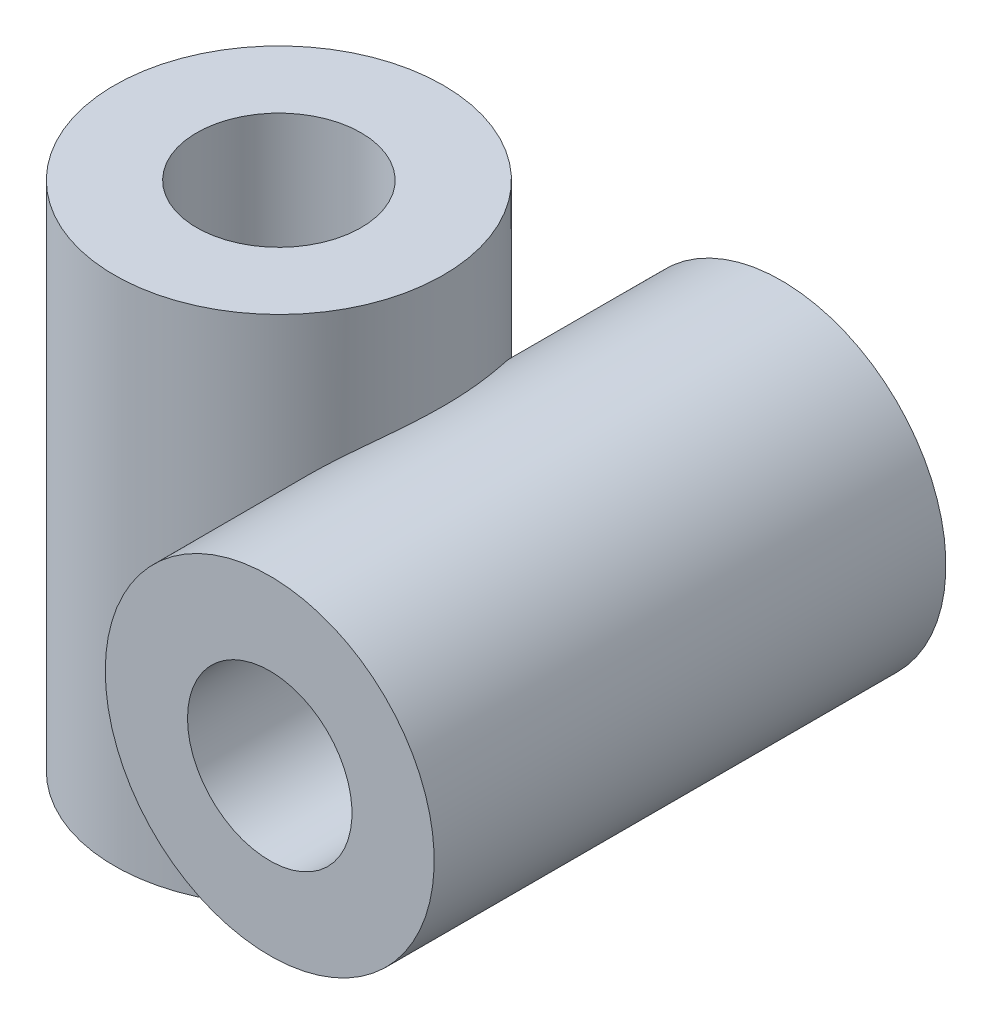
ISO-10303-21;
HEADER;
FILE_DESCRIPTION(('STEP AP214'),'2;1');
FILE_NAME('part.step','',(''),(''),'','','');
FILE_SCHEMA(('AUTOMOTIVE_DESIGN { 1 0 10303 214 1 1 1 1 }'));
ENDSEC;
DATA;
#1=APPLICATION_CONTEXT('core data for automotive mechanical design processes');
#2=APPLICATION_PROTOCOL_DEFINITION('international standard','automotive_design',2000,#1);
#3=PRODUCT_CONTEXT('',#1,'mechanical');
#4=PRODUCT('Part','Part','',(#3));
#5=PRODUCT_RELATED_PRODUCT_CATEGORY('part','',(#4));
#6=PRODUCT_DEFINITION_FORMATION('','',#4);
#7=PRODUCT_DEFINITION_CONTEXT('part definition',#1,'design');
#8=PRODUCT_DEFINITION('design','',#6,#7);
#9=PRODUCT_DEFINITION_SHAPE('','',#8);
#10=(LENGTH_UNIT() NAMED_UNIT(*) SI_UNIT(.MILLI.,.METRE.));
#11=(NAMED_UNIT(*) PLANE_ANGLE_UNIT() SI_UNIT($,.RADIAN.));
#12=(NAMED_UNIT(*) SI_UNIT($,.STERADIAN.) SOLID_ANGLE_UNIT());
#13=UNCERTAINTY_MEASURE_WITH_UNIT(LENGTH_MEASURE(1.E-05),#10,'distance_accuracy_value','');
#14=(GEOMETRIC_REPRESENTATION_CONTEXT(3) GLOBAL_UNCERTAINTY_ASSIGNED_CONTEXT((#13)) GLOBAL_UNIT_ASSIGNED_CONTEXT((#10,
#11,#12)) REPRESENTATION_CONTEXT('',''));
#15=CARTESIAN_POINT('',(0.,0.,0.));
#16=DIRECTION('',(0.,0.,1.));
#17=DIRECTION('',(1.,0.,0.));
#18=AXIS2_PLACEMENT_3D('',#15,#16,#17);
#19=CARTESIAN_POINT('',(13.5,0.,14.00003));
#20=DIRECTION('',(0.,0.,-1.));
#21=DIRECTION('',(-1.,0.,0.));
#22=AXIS2_PLACEMENT_3D('',#19,#20,#21);
#23=CYLINDRICAL_SURFACE('',#22,9.);
#24=CARTESIAN_POINT('',(4.5,0.,7.79422863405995));
#25=CARTESIAN_POINT('',(4.49999878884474,0.210530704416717,7.79422744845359));
#26=CARTESIAN_POINT('',(4.50739316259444,0.421042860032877,7.78997368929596));
#27=CARTESIAN_POINT('',(4.53688683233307,0.840749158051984,7.77283452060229));
#28=CARTESIAN_POINT('',(4.55898999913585,1.04994293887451,7.75994683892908));
#29=CARTESIAN_POINT('',(4.61768183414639,1.46580210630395,7.72516517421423));
#30=CARTESIAN_POINT('',(4.65428858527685,1.67246400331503,7.70325994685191));
#31=CARTESIAN_POINT('',(4.74152309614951,2.08154101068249,7.64987402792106));
#32=CARTESIAN_POINT('',(4.79214987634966,2.2839564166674,7.61839400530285));
#33=CARTESIAN_POINT('',(4.90686390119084,2.68352543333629,7.54502024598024));
#34=CARTESIAN_POINT('',(4.97098135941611,2.88066609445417,7.50310309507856));
#35=CARTESIAN_POINT('',(5.11163620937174,3.26768097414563,7.40799421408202));
#36=CARTESIAN_POINT('',(5.18817384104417,3.4575550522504,7.35480226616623));
#37=CARTESIAN_POINT('',(5.35230548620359,3.8283339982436,7.23623250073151));
#38=CARTESIAN_POINT('',(5.43989058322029,4.00924593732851,7.17086449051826));
#39=CARTESIAN_POINT('',(5.62450750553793,4.36073564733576,7.02699080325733));
#40=CARTESIAN_POINT('',(5.72153872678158,4.53131407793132,6.94848596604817));
#41=CARTESIAN_POINT('',(5.91883748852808,4.85388813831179,6.78110515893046));
#42=CARTESIAN_POINT('',(6.01880394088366,5.00636104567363,6.6927943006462));
#43=CARTESIAN_POINT('',(6.22346287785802,5.29942914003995,6.5029210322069));
#44=CARTESIAN_POINT('',(6.32815522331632,5.44002467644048,6.40135901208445));
#45=CARTESIAN_POINT('',(6.53991020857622,5.70844720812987,6.18485932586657));
#46=CARTESIAN_POINT('',(6.64697194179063,5.8362789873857,6.06992670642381));
#47=CARTESIAN_POINT('',(6.86106162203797,6.0787049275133,5.82683878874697));
#48=CARTESIAN_POINT('',(6.96808957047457,6.19329973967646,5.69868414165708));
#49=CARTESIAN_POINT('',(7.17185654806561,6.40110919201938,5.43963182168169));
#50=CARTESIAN_POINT('',(7.2687717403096,6.49527774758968,5.30963550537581));
#51=CARTESIAN_POINT('',(7.45864427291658,6.672246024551,5.03943293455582));
#52=CARTESIAN_POINT('',(7.55160182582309,6.75504635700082,4.89922722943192));
#53=CARTESIAN_POINT('',(7.73190863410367,6.90964803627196,4.60941662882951));
#54=CARTESIAN_POINT('',(7.81925662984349,6.98144691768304,4.45980963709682));
#55=CARTESIAN_POINT('',(7.98686265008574,7.11454664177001,4.15219322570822));
#56=CARTESIAN_POINT('',(8.06712039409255,7.17584706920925,3.9941834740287));
#57=CARTESIAN_POINT('',(8.22098364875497,7.28981190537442,3.66725778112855));
#58=CARTESIAN_POINT('',(8.29440424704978,7.34225696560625,3.49817848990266));
#59=CARTESIAN_POINT('',(8.43148190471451,7.43754630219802,3.15349291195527));
#60=CARTESIAN_POINT('',(8.49513890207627,7.48039051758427,2.97788658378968));
#61=CARTESIAN_POINT('',(8.61186892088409,7.55718594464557,2.62124579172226));
#62=CARTESIAN_POINT('',(8.66493906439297,7.59113473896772,2.44020986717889));
#63=CARTESIAN_POINT('',(8.75984198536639,7.6507543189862,2.07387978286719));
#64=CARTESIAN_POINT('',(8.80167421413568,7.67642470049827,1.88858541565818));
#65=CARTESIAN_POINT('',(8.87669096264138,7.72185891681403,1.49898951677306));
#66=CARTESIAN_POINT('',(8.90884179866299,7.74093757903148,1.29440827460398));
#67=CARTESIAN_POINT('',(8.95898776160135,7.77046026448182,0.882898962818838));
#68=CARTESIAN_POINT('',(8.97698216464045,7.78090384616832,0.675970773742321));
#69=CARTESIAN_POINT('',(8.99861286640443,7.79343771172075,0.261036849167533));
#70=CARTESIAN_POINT('',(9.00224389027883,7.79552492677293,0.053030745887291));
#71=CARTESIAN_POINT('',(8.995092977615,7.79139447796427,-0.362652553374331));
#72=CARTESIAN_POINT('',(8.98431076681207,7.78517665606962,-0.570329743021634));
#73=CARTESIAN_POINT('',(8.94755589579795,7.76374483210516,-0.994363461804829));
#74=CARTESIAN_POINT('',(8.9208512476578,7.74809690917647,-1.2106352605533));
#75=CARTESIAN_POINT('',(8.85202487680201,7.70700532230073,-1.63978124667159));
#76=CARTESIAN_POINT('',(8.80990249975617,7.68156124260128,-1.85265528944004));
#77=CARTESIAN_POINT('',(8.71082235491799,7.62018188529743,-2.27338404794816));
#78=CARTESIAN_POINT('',(8.65386491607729,7.58424684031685,-2.48123887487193));
#79=CARTESIAN_POINT('',(8.52597562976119,7.50099324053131,-2.89026732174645));
#80=CARTESIAN_POINT('',(8.45504434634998,7.45367514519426,-3.09144121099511));
#81=CARTESIAN_POINT('',(8.30202749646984,7.34775812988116,-3.48127231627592));
#82=CARTESIAN_POINT('',(8.22020769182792,7.28941720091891,-3.67010373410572));
#83=CARTESIAN_POINT('',(8.04579734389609,7.15985101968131,-4.03814380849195));
#84=CARTESIAN_POINT('',(7.95320691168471,7.08862590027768,-4.21735256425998));
#85=CARTESIAN_POINT('',(7.75920504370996,6.93244239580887,-4.56445309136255));
#86=CARTESIAN_POINT('',(7.65780116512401,6.84749572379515,-4.73235434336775));
#87=CARTESIAN_POINT('',(7.44835948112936,6.66311438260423,-5.05559286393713));
#88=CARTESIAN_POINT('',(7.34032231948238,6.56368111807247,-5.21093134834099));
#89=CARTESIAN_POINT('',(7.1293195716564,6.35879108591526,-5.49559442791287));
#90=CARTESIAN_POINT('',(7.0266746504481,6.25451459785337,-5.62600799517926));
#91=CARTESIAN_POINT('',(6.82014578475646,6.03344159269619,-5.87466867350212));
#92=CARTESIAN_POINT('',(6.71626191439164,5.91664582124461,-5.99291650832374));
#93=CARTESIAN_POINT('',(6.50948901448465,5.67085013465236,-6.21689562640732));
#94=CARTESIAN_POINT('',(6.40659988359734,5.54185147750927,-6.3226281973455));
#95=CARTESIAN_POINT('',(6.20398040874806,5.27224120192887,-6.52156366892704));
#96=CARTESIAN_POINT('',(6.10425004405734,5.13162965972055,-6.61476665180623));
#97=CARTESIAN_POINT('',(5.91462959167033,4.84665188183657,-6.78473223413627));
#98=CARTESIAN_POINT('',(5.82449698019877,4.70278792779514,-6.86206839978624));
#99=CARTESIAN_POINT('',(5.65048898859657,4.40621527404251,-7.00604960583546));
#100=CARTESIAN_POINT('',(5.56661336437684,4.25350691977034,-7.0726950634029));
#101=CARTESIAN_POINT('',(5.40643461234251,3.94019852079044,-7.19587943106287));
#102=CARTESIAN_POINT('',(5.33013344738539,3.77959644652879,-7.25241572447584));
#103=CARTESIAN_POINT('',(5.18623581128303,3.45158033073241,-7.35600573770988));
#104=CARTESIAN_POINT('',(5.11863977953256,3.28416594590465,-7.4030589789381));
#105=CARTESIAN_POINT('',(4.98950286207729,2.93397361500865,-7.49074749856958));
#106=CARTESIAN_POINT('',(4.92851917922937,2.75086187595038,-7.53087055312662));
#107=CARTESIAN_POINT('',(4.81808374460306,2.37946845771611,-7.60199868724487));
#108=CARTESIAN_POINT('',(4.76863232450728,2.19118663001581,-7.63300350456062));
#109=CARTESIAN_POINT('',(4.68184831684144,1.8106092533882,-7.68654008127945));
#110=CARTESIAN_POINT('',(4.64451945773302,1.61831248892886,-7.70906923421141));
#111=CARTESIAN_POINT('',(4.58241803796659,1.23094166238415,-7.74614426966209));
#112=CARTESIAN_POINT('',(4.55764599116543,1.03586748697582,-7.76068982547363));
#113=CARTESIAN_POINT('',(4.51943914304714,0.628276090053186,-7.7830076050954));
#114=CARTESIAN_POINT('',(4.50708088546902,0.41562190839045,-7.79013831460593));
#115=CARTESIAN_POINT('',(4.49748663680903,-0.0101469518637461,-7.79568100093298));
#116=CARTESIAN_POINT('',(4.50025145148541,-0.223261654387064,-7.7940925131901));
#117=CARTESIAN_POINT('',(4.52087544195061,-0.648588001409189,-7.78214803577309));
#118=CARTESIAN_POINT('',(4.5387397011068,-0.860799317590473,-7.7717890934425));
#119=CARTESIAN_POINT('',(4.58935541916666,-1.28279951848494,-7.74200733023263));
#120=CARTESIAN_POINT('',(4.62210691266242,-1.49258839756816,-7.72258448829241));
#121=CARTESIAN_POINT('',(4.70312648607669,-1.91367868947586,-7.67351968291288));
#122=CARTESIAN_POINT('',(4.75177576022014,-2.12487767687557,-7.64362521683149));
#123=CARTESIAN_POINT('',(4.86361815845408,-2.54154187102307,-7.57295126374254));
#124=CARTESIAN_POINT('',(4.92681170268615,-2.74700691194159,-7.53217146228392));
#125=CARTESIAN_POINT('',(5.06671285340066,-3.15043261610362,-7.43878264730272));
#126=CARTESIAN_POINT('',(5.14341510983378,-3.34839621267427,-7.38617831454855));
#127=CARTESIAN_POINT('',(5.30898939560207,-3.73518221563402,-7.26807840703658));
#128=CARTESIAN_POINT('',(5.39786056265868,-3.9240052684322,-7.20258374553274));
#129=CARTESIAN_POINT('',(5.58151197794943,-4.28206516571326,-7.06112586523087));
#130=CARTESIAN_POINT('',(5.67580773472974,-4.45180669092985,-6.9858115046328));
#131=CARTESIAN_POINT('',(5.87194342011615,-4.7800948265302,-6.82177493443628));
#132=CARTESIAN_POINT('',(5.97378308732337,-4.93864182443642,-6.73305318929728));
#133=CARTESIAN_POINT('',(6.18270884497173,-5.24321793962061,-6.54172379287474));
#134=CARTESIAN_POINT('',(6.28979105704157,-5.38925609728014,-6.4391263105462));
#135=CARTESIAN_POINT('',(6.5067804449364,-5.66798672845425,-6.21977402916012));
#136=CARTESIAN_POINT('',(6.61668740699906,-5.80068020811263,-6.10302029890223));
#137=CARTESIAN_POINT('',(6.82729091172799,-6.04138362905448,-5.86609187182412));
#138=CARTESIAN_POINT('',(6.92797299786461,-6.15053367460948,-5.74705950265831));
#139=CARTESIAN_POINT('',(7.12746179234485,-6.35699332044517,-5.49770607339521));
#140=CARTESIAN_POINT('',(7.2262686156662,-6.45430364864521,-5.36738570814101));
#141=CARTESIAN_POINT('',(7.42008242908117,-6.63719578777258,-5.09609368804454));
#142=CARTESIAN_POINT('',(7.51508883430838,-6.72277579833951,-4.95512040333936));
#143=CARTESIAN_POINT('',(7.69951226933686,-6.88253099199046,-4.66339888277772));
#144=CARTESIAN_POINT('',(7.78892916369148,-6.95670589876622,-4.51265041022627));
#145=CARTESIAN_POINT('',(7.9597882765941,-7.09351266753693,-4.20387996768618));
#146=CARTESIAN_POINT('',(8.04129887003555,-7.15624860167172,-4.04594181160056));
#147=CARTESIAN_POINT('',(8.19603107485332,-7.27167340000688,-3.72252755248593));
#148=CARTESIAN_POINT('',(8.26925280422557,-7.32436240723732,-3.55705155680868));
#149=CARTESIAN_POINT('',(8.40638392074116,-7.42038319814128,-3.21960984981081));
#150=CARTESIAN_POINT('',(8.47029102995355,-7.46371269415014,-3.04764256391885));
#151=CARTESIAN_POINT('',(8.58795215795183,-7.54166872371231,-2.69834206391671));
#152=CARTESIAN_POINT('',(8.64170544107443,-7.57629462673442,-2.52100846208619));
#153=CARTESIAN_POINT('',(8.74221022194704,-7.63984625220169,-2.14800503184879));
#154=CARTESIAN_POINT('',(8.78808463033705,-7.66811387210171,-1.95198625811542));
#155=CARTESIAN_POINT('',(8.86671740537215,-7.7158802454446,-1.5562846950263));
#156=CARTESIAN_POINT('',(8.89947518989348,-7.73537860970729,-1.35660174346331));
#157=CARTESIAN_POINT('',(8.95150481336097,-7.76608690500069,-0.954785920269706));
#158=CARTESIAN_POINT('',(8.97077191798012,-7.77729392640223,-0.752652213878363));
#159=CARTESIAN_POINT('',(8.99559092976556,-7.79169447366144,-0.347259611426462));
#160=CARTESIAN_POINT('',(9.00114242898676,-7.79488776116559,-0.144000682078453));
#161=CARTESIAN_POINT('',(8.99837973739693,-7.79329365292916,0.275838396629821));
#162=CARTESIAN_POINT('',(8.98912491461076,-7.78796486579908,0.492411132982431));
#163=CARTESIAN_POINT('',(8.95506667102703,-7.76813792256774,0.923918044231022));
#164=CARTESIAN_POINT('',(8.93026248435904,-7.75363931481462,1.13885213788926));
#165=CARTESIAN_POINT('',(8.8654116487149,-7.71505117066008,1.56558535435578));
#166=CARTESIAN_POINT('',(8.82536209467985,-7.69095980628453,1.77738387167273));
#167=CARTESIAN_POINT('',(8.73056018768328,-7.63253183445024,2.19622818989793));
#168=CARTESIAN_POINT('',(8.67580811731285,-7.59819542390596,2.40327408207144));
#169=CARTESIAN_POINT('',(8.55240402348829,-7.51842331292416,2.81100500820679));
#170=CARTESIAN_POINT('',(8.48375167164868,-7.47298735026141,3.01168989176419));
#171=CARTESIAN_POINT('',(8.33366807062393,-7.37002647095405,3.4050377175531));
#172=CARTESIAN_POINT('',(8.25223670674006,-7.31250144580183,3.59770058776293));
#173=CARTESIAN_POINT('',(8.07814986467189,-7.18437233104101,3.97319595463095));
#174=CARTESIAN_POINT('',(7.98550252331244,-7.11377770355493,4.15603544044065));
#175=CARTESIAN_POINT('',(7.79083618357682,-6.95851518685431,4.51040194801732));
#176=CARTESIAN_POINT('',(7.68881806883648,-6.87384862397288,4.68193003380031));
#177=CARTESIAN_POINT('',(7.48520064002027,-6.69620172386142,5.00049459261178));
#178=CARTESIAN_POINT('',(7.38408357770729,-6.60423516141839,5.14840527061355));
#179=CARTESIAN_POINT('',(7.17788518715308,-6.40712060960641,5.43219328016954));
#180=CARTESIAN_POINT('',(7.07280406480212,-6.30197330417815,5.56807123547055));
#181=CARTESIAN_POINT('',(6.86105028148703,-6.07848863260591,5.82700239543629));
#182=CARTESIAN_POINT('',(6.75437835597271,-5.96015720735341,5.95006132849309));
#183=CARTESIAN_POINT('',(6.5418077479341,-5.71055334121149,6.18301062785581));
#184=CARTESIAN_POINT('',(6.43590903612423,-5.57928139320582,6.29290149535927));
#185=CARTESIAN_POINT('',(6.23463524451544,-5.31414995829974,6.49214497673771));
#186=CARTESIAN_POINT('',(6.13904548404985,-5.18112960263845,6.58240036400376));
#187=CARTESIAN_POINT('',(5.95235697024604,-4.90518385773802,6.75169078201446));
#188=CARTESIAN_POINT('',(5.86125799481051,-4.76225895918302,6.83072636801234));
#189=CARTESIAN_POINT('',(5.68510021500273,-4.46731066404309,6.97802491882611));
#190=CARTESIAN_POINT('',(5.60004456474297,-4.31528259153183,7.04628228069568));
#191=CARTESIAN_POINT('',(5.43740372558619,-4.00318739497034,7.17253395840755));
#192=CARTESIAN_POINT('',(5.35981875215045,-3.84312003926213,7.23052797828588));
#193=CARTESIAN_POINT('',(5.2110228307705,-3.51097976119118,7.33852539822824));
#194=CARTESIAN_POINT('',(5.14008048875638,-3.33868916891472,7.38822903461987));
#195=CARTESIAN_POINT('',(5.00836610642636,-2.98785395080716,7.47814347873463));
#196=CARTESIAN_POINT('',(4.94759478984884,-2.80930888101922,7.51835361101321));
#197=CARTESIAN_POINT('',(4.83705225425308,-2.44727010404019,7.58994484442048));
#198=CARTESIAN_POINT('',(4.78727291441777,-2.26378016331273,7.62133246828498));
#199=CARTESIAN_POINT('',(4.69924933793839,-1.89291289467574,7.67591877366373));
#200=CARTESIAN_POINT('',(4.66100296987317,-1.70553629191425,7.69911896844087));
#201=CARTESIAN_POINT('',(4.58607215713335,-1.26724471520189,7.74405980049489));
#202=CARTESIAN_POINT('',(4.55383817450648,-1.01525909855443,7.76293625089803));
#203=CARTESIAN_POINT('',(4.51080228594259,-0.508840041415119,7.7880217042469));
#204=CARTESIAN_POINT('',(4.50000146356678,-0.254406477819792,7.79423006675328));
#205=CARTESIAN_POINT('',(4.5,0.,7.79422863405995));
#206=B_SPLINE_CURVE_WITH_KNOTS('',3,(#24,#25,#26,#27,#28,#29,#30,#31,#32,#33,#34,#35,#36,#37,
#38,#39,#40,#41,#42,#43,#44,#45,#46,#47,#48,#49,#50,#51,#52,#53,#54,#55,#56,#57,#58,#59,#60,#61,
#62,#63,#64,#65,#66,#67,#68,#69,#70,#71,#72,#73,#74,#75,#76,#77,#78,#79,#80,#81,#82,#83,#84,#85,
#86,#87,#88,#89,#90,#91,#92,#93,#94,#95,#96,#97,#98,#99,#100,#101,#102,#103,#104,#105,#106,#107,
#108,#109,#110,#111,#112,#113,#114,#115,#116,#117,#118,#119,#120,#121,#122,#123,#124,#125,#126,
#127,#128,#129,#130,#131,#132,#133,#134,#135,#136,#137,#138,#139,#140,#141,#142,#143,#144,#145,
#146,#147,#148,#149,#150,#151,#152,#153,#154,#155,#156,#157,#158,#159,#160,#161,#162,#163,#164,
#165,#166,#167,#168,#169,#170,#171,#172,#173,#174,#175,#176,#177,#178,#179,#180,#181,#182,#183,
#184,#185,#186,#187,#188,#189,#190,#191,#192,#193,#194,#195,#196,#197,#198,#199,#200,#201,#202,
#203,#204,#205),.UNSPECIFIED.,.T.,.F.,(4,2,2,2,2,2,2,2,2,2,2,2,2,2,2,2,2,2,2,2,2,2,2,2,2,2,2,2,
2,2,2,2,2,2,2,2,2,2,2,2,2,2,2,2,2,2,2,2,2,2,2,2,2,2,2,2,2,2,2,2,2,2,2,2,2,2,2,2,2,2,2,2,2,2,2,2,
2,2,2,2,2,2,2,2,2,2,2,2,2,2,4),(0.,0.631386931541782,1.26294008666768,1.89528314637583,
2.52758203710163,3.16131238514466,3.79505497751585,4.42828930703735,5.06148316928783,
5.668418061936,6.27533509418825,6.88202378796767,7.48868261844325,8.05054385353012,
8.61237487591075,9.17433162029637,9.7363105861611,10.3106375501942,10.8849681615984,
11.4594546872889,12.0339692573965,12.6571859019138,13.2804344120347,13.9039117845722,
14.5274010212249,15.1820391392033,15.8367050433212,16.4913564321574,17.145981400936,
17.7868480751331,18.4277081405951,19.0680240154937,19.7082778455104,20.2955233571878,
20.8827339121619,21.4698839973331,22.0570302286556,22.6160585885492,23.1750651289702,
23.7342161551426,24.2933953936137,24.8841398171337,25.4749012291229,26.0658441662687,
26.6568112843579,27.2954810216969,27.9341847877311,28.5731036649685,29.2120240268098,
29.8675518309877,30.5230985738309,31.1783862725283,31.8336275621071,32.4575946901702,
33.0815402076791,33.7050309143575,34.3284745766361,34.8987115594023,35.4689134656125,
36.0392027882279,36.6095059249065,37.1743288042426,37.7391436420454,38.3040963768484,
38.8690900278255,39.4782968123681,40.0875306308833,40.6969781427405,41.3064437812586,
41.9561890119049,42.6059662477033,43.2558673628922,43.9057559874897,44.5556599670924,
45.2055697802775,45.8550108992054,46.504390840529,47.1077704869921,47.711118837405,
48.3141964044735,48.9172510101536,49.4776687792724,50.0380588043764,50.5987391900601,
51.1594357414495,51.7373356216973,52.3152766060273,52.8927891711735,53.4701949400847,
54.2331278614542,54.9960993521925),.UNSPECIFIED.);
#207=CARTESIAN_POINT('',(4.5,0.,7.79422863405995));
#208=VERTEX_POINT('',#207);
#209=EDGE_CURVE('E10',#208,#208,#206,.T.);
#210=ORIENTED_EDGE('',*,*,#209,.F.);
#211=EDGE_LOOP('',(#210));
#212=FACE_BOUND('',#211,.T.);
#213=CARTESIAN_POINT('',(13.5,0.,14.));
#214=DIRECTION('',(0.,0.,-1.));
#215=DIRECTION('',(-1.,0.,0.));
#216=AXIS2_PLACEMENT_3D('',#213,#214,#215);
#217=CIRCLE('',#216,8.99999999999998);
#218=CARTESIAN_POINT('',(4.50000000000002,0.,14.));
#219=VERTEX_POINT('',#218);
#220=EDGE_CURVE('E40',#219,#219,#217,.T.);
#221=ORIENTED_EDGE('',*,*,#220,.T.);
#222=EDGE_LOOP('',(#221));
#223=FACE_BOUND('',#222,.T.);
#224=CARTESIAN_POINT('',(13.5,0.,-14.));
#225=DIRECTION('',(0.,0.,-1.));
#226=DIRECTION('',(-1.,0.,0.));
#227=AXIS2_PLACEMENT_3D('',#224,#225,#226);
#228=CIRCLE('',#227,9.00000000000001);
#229=CARTESIAN_POINT('',(4.49999999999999,0.,-14.));
#230=VERTEX_POINT('',#229);
#231=EDGE_CURVE('E44',#230,#230,#228,.T.);
#232=ORIENTED_EDGE('',*,*,#231,.F.);
#233=EDGE_LOOP('',(#232));
#234=FACE_BOUND('',#233,.T.);
#235=ADVANCED_FACE('F30',(#212,#223,#234),#23,.T.);
#236=CARTESIAN_POINT('',(22.5,0.,14.));
#237=DIRECTION('',(0.,0.,1.));
#238=DIRECTION('',(1.,0.,0.));
#239=AXIS2_PLACEMENT_3D('',#236,#237,#238);
#240=PLANE('',#239);
#241=CARTESIAN_POINT('',(13.5,0.,14.));
#242=DIRECTION('',(0.,0.,-1.));
#243=DIRECTION('',(-1.,0.,0.));
#244=AXIS2_PLACEMENT_3D('',#241,#242,#243);
#245=CIRCLE('',#244,4.49999999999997);
#246=CARTESIAN_POINT('',(9.00000000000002,0.,14.));
#247=VERTEX_POINT('',#246);
#248=EDGE_CURVE('E62',#247,#247,#245,.T.);
#249=ORIENTED_EDGE('',*,*,#248,.T.);
#250=EDGE_LOOP('',(#249));
#251=FACE_BOUND('',#250,.T.);
#252=ORIENTED_EDGE('',*,*,#220,.F.);
#253=EDGE_LOOP('',(#252));
#254=FACE_BOUND('',#253,.T.);
#255=ADVANCED_FACE('F75',(#251,#254),#240,.T.);
#256=CARTESIAN_POINT('',(13.5,0.,-14.));
#257=DIRECTION('',(0.,0.,-1.));
#258=DIRECTION('',(-1.,0.,0.));
#259=AXIS2_PLACEMENT_3D('',#256,#257,#258);
#260=PLANE('',#259);
#261=CARTESIAN_POINT('',(13.5,0.,-14.));
#262=DIRECTION('',(0.,0.,-1.));
#263=DIRECTION('',(-1.,0.,0.));
#264=AXIS2_PLACEMENT_3D('',#261,#262,#263);
#265=CIRCLE('',#264,4.49999999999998);
#266=CARTESIAN_POINT('',(9.00000000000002,0.,-14.));
#267=VERTEX_POINT('',#266);
#268=EDGE_CURVE('E65',#267,#267,#265,.T.);
#269=ORIENTED_EDGE('',*,*,#268,.F.);
#270=EDGE_LOOP('',(#269));
#271=FACE_BOUND('',#270,.T.);
#272=ORIENTED_EDGE('',*,*,#231,.T.);
#273=EDGE_LOOP('',(#272));
#274=FACE_BOUND('',#273,.T.);
#275=ADVANCED_FACE('F71',(#271,#274),#260,.T.);
#276=CARTESIAN_POINT('',(0.,-14.,0.));
#277=DIRECTION('',(0.,-1.,0.));
#278=DIRECTION('',(0.,0.,-1.));
#279=AXIS2_PLACEMENT_3D('',#276,#277,#278);
#280=PLANE('',#279);
#281=CARTESIAN_POINT('',(0.,-14.,0.));
#282=DIRECTION('',(0.,-1.,0.));
#283=DIRECTION('',(0.,0.,-1.));
#284=AXIS2_PLACEMENT_3D('',#281,#282,#283);
#285=CIRCLE('',#284,4.49999999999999);
#286=CARTESIAN_POINT('',(0.,-14.,-4.49999999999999));
#287=VERTEX_POINT('',#286);
#288=EDGE_CURVE('E59',#287,#287,#285,.T.);
#289=ORIENTED_EDGE('',*,*,#288,.F.);
#290=EDGE_LOOP('',(#289));
#291=FACE_BOUND('',#290,.T.);
#292=CARTESIAN_POINT('',(0.,-14.,0.));
#293=DIRECTION('',(0.,-1.,0.));
#294=DIRECTION('',(0.,0.,-1.));
#295=AXIS2_PLACEMENT_3D('',#292,#293,#294);
#296=CIRCLE('',#295,9.);
#297=CARTESIAN_POINT('',(0.,-14.,-9.));
#298=VERTEX_POINT('',#297);
#299=EDGE_CURVE('E48',#298,#298,#296,.T.);
#300=ORIENTED_EDGE('',*,*,#299,.T.);
#301=EDGE_LOOP('',(#300));
#302=FACE_BOUND('',#301,.T.);
#303=ADVANCED_FACE('F74',(#291,#302),#280,.T.);
#304=CARTESIAN_POINT('',(0.,14.,0.));
#305=DIRECTION('',(0.,-1.,0.));
#306=DIRECTION('',(0.,0.,-1.));
#307=AXIS2_PLACEMENT_3D('',#304,#305,#306);
#308=CYLINDRICAL_SURFACE('',#307,9.);
#309=ORIENTED_EDGE('',*,*,#209,.T.);
#310=EDGE_LOOP('',(#309));
#311=FACE_BOUND('',#310,.T.);
#312=CARTESIAN_POINT('',(0.,14.,0.));
#313=DIRECTION('',(0.,-1.,0.));
#314=DIRECTION('',(0.,0.,-1.));
#315=AXIS2_PLACEMENT_3D('',#312,#313,#314);
#316=CIRCLE('',#315,9.);
#317=CARTESIAN_POINT('',(0.,14.,-9.));
#318=VERTEX_POINT('',#317);
#319=EDGE_CURVE('E53',#318,#318,#316,.T.);
#320=ORIENTED_EDGE('',*,*,#319,.T.);
#321=EDGE_LOOP('',(#320));
#322=FACE_BOUND('',#321,.T.);
#323=ORIENTED_EDGE('',*,*,#299,.F.);
#324=EDGE_LOOP('',(#323));
#325=FACE_BOUND('',#324,.T.);
#326=ADVANCED_FACE('F90',(#311,#322,#325),#308,.T.);
#327=CARTESIAN_POINT('',(0.,14.,-9.));
#328=DIRECTION('',(0.,1.,0.));
#329=DIRECTION('',(0.,0.,1.));
#330=AXIS2_PLACEMENT_3D('',#327,#328,#329);
#331=PLANE('',#330);
#332=CARTESIAN_POINT('',(0.,14.,0.));
#333=DIRECTION('',(0.,-1.,0.));
#334=DIRECTION('',(0.,0.,-1.));
#335=AXIS2_PLACEMENT_3D('',#332,#333,#334);
#336=CIRCLE('',#335,4.49999999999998);
#337=CARTESIAN_POINT('',(0.,14.,-4.49999999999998));
#338=VERTEX_POINT('',#337);
#339=EDGE_CURVE('E56',#338,#338,#336,.T.);
#340=ORIENTED_EDGE('',*,*,#339,.T.);
#341=EDGE_LOOP('',(#340));
#342=FACE_BOUND('',#341,.T.);
#343=ORIENTED_EDGE('',*,*,#319,.F.);
#344=EDGE_LOOP('',(#343));
#345=FACE_BOUND('',#344,.T.);
#346=ADVANCED_FACE('F95',(#342,#345),#331,.T.);
#347=CARTESIAN_POINT('',(0.,-14.,0.));
#348=DIRECTION('',(0.,-1.,0.));
#349=DIRECTION('',(0.,0.,-1.));
#350=AXIS2_PLACEMENT_3D('',#347,#348,#349);
#351=CYLINDRICAL_SURFACE('',#350,4.49999999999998);
#352=ORIENTED_EDGE('',*,*,#339,.F.);
#353=EDGE_LOOP('',(#352));
#354=FACE_BOUND('',#353,.T.);
#355=ORIENTED_EDGE('',*,*,#288,.T.);
#356=EDGE_LOOP('',(#355));
#357=FACE_BOUND('',#356,.T.);
#358=ADVANCED_FACE('F98',(#354,#357),#351,.F.);
#359=CARTESIAN_POINT('',(13.5,0.,-14.));
#360=DIRECTION('',(0.,0.,-1.));
#361=DIRECTION('',(-1.,0.,0.));
#362=AXIS2_PLACEMENT_3D('',#359,#360,#361);
#363=CYLINDRICAL_SURFACE('',#362,4.49999999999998);
#364=ORIENTED_EDGE('',*,*,#248,.F.);
#365=EDGE_LOOP('',(#364));
#366=FACE_BOUND('',#365,.T.);
#367=ORIENTED_EDGE('',*,*,#268,.T.);
#368=EDGE_LOOP('',(#367));
#369=FACE_BOUND('',#368,.T.);
#370=ADVANCED_FACE('F69',(#366,#369),#363,.F.);
#371=CLOSED_SHELL('',(#235,#255,#275,#303,#326,#346,#358,#370));
#372=MANIFOLD_SOLID_BREP('B2',#371);
#373=ADVANCED_BREP_SHAPE_REPRESENTATION('',(#18,#372),#14);
#374=SHAPE_DEFINITION_REPRESENTATION(#9,#373);
ENDSEC;
END-ISO-10303-21;
